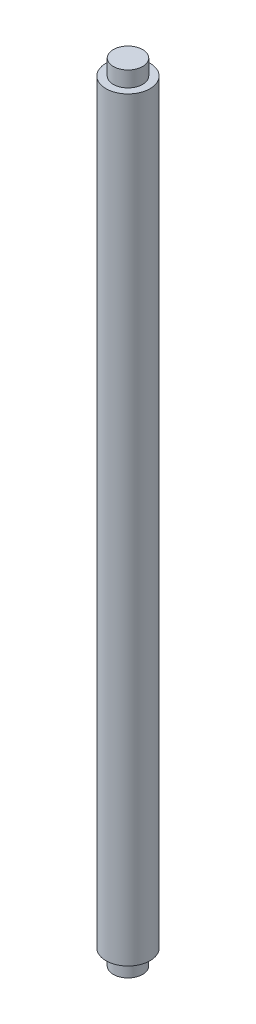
from build123d import *

# Parameters (mm, degrees)
SKETCH1_R           = 2.25
BOSS_EXTRUDE1_DEPTH = 77.1
SKETCH2_R           = 1.5
BOSS_EXTRUDE2_DEPTH = 1.5875
BOSS_EXTRUDE3_START = 1.5875
SKETCH3_R           = 1.5
BOSS_EXTRUDE3_DEPTH = 1.5875


with BuildPart() as part:
    # Sketch1 → Boss-Extrude1 (new body)
    with BuildSketch(Plane(origin=(0, 0, 0), x_dir=(1, 0, 0), z_dir=(0, 1, 0))):
        with Locations(Location((0, 0, 0), (0, 0, 270))):
            Circle(SKETCH1_R)
    extrude(amount=BOSS_EXTRUDE1_DEPTH)

    # Sketch2 → Boss-Extrude2 (add)
    with BuildSketch(Plane.XZ):
        with Locations(Location((0, 0, 0), (0, 0, 270))):
            Circle(SKETCH2_R)
    extrude(amount=BOSS_EXTRUDE2_DEPTH)

    # Sketch3 → Boss-Extrude3 (add)
    with BuildSketch(Plane(origin=(0, 77.1, 0), x_dir=(1, 0, 0), z_dir=(0, 1, 0)).offset(BOSS_EXTRUDE3_START)):
        with Locations(Location((0, 0, 0), (0, 0, 90))):
            Circle(SKETCH3_R)
    extrude(amount=-BOSS_EXTRUDE3_DEPTH)


solid = part.part
